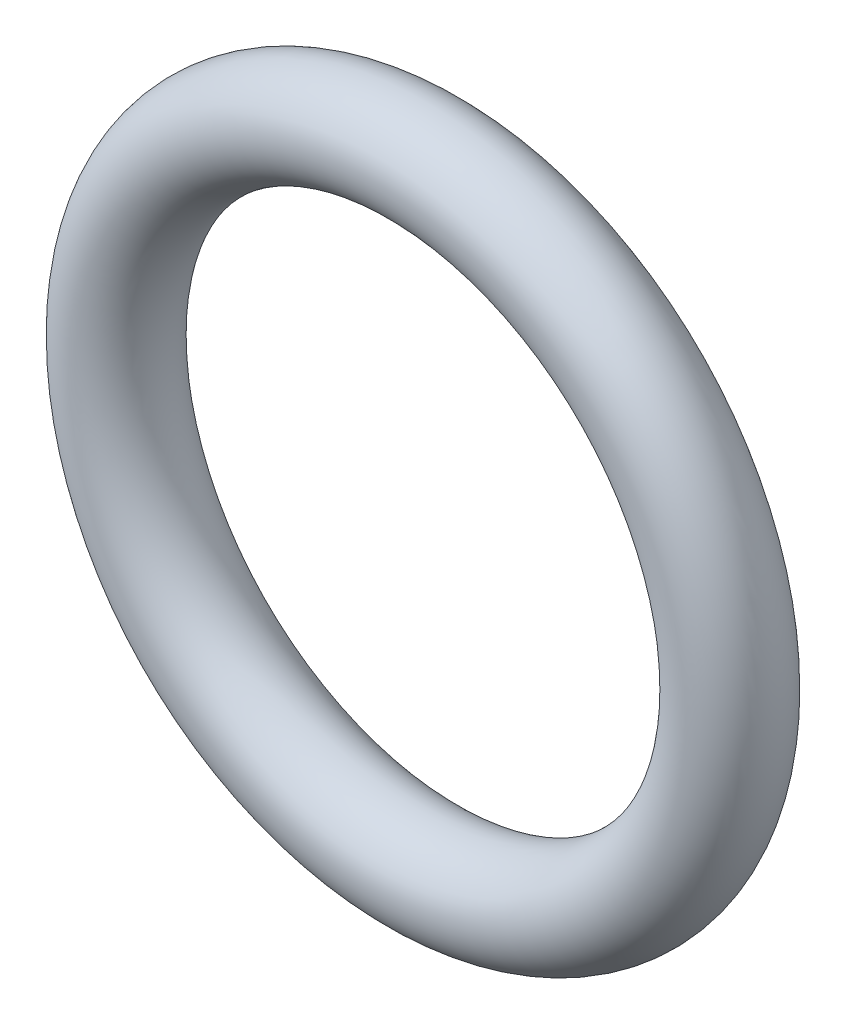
ISO-10303-21;
HEADER;
FILE_DESCRIPTION(('STEP AP214'),'2;1');
FILE_NAME('part.step','',(''),(''),'','','');
FILE_SCHEMA(('AUTOMOTIVE_DESIGN { 1 0 10303 214 1 1 1 1 }'));
ENDSEC;
DATA;
#1=APPLICATION_CONTEXT('core data for automotive mechanical design processes');
#2=APPLICATION_PROTOCOL_DEFINITION('international standard','automotive_design',2000,#1);
#3=PRODUCT_CONTEXT('',#1,'mechanical');
#4=PRODUCT('Part','Part','',(#3));
#5=PRODUCT_RELATED_PRODUCT_CATEGORY('part','',(#4));
#6=PRODUCT_DEFINITION_FORMATION('','',#4);
#7=PRODUCT_DEFINITION_CONTEXT('part definition',#1,'design');
#8=PRODUCT_DEFINITION('design','',#6,#7);
#9=PRODUCT_DEFINITION_SHAPE('','',#8);
#10=(LENGTH_UNIT() NAMED_UNIT(*) SI_UNIT(.MILLI.,.METRE.));
#11=(NAMED_UNIT(*) PLANE_ANGLE_UNIT() SI_UNIT($,.RADIAN.));
#12=(NAMED_UNIT(*) SI_UNIT($,.STERADIAN.) SOLID_ANGLE_UNIT());
#13=UNCERTAINTY_MEASURE_WITH_UNIT(LENGTH_MEASURE(1.E-05),#10,'distance_accuracy_value','');
#14=(GEOMETRIC_REPRESENTATION_CONTEXT(3) GLOBAL_UNCERTAINTY_ASSIGNED_CONTEXT((#13)) GLOBAL_UNIT_ASSIGNED_CONTEXT((#10,
#11,#12)) REPRESENTATION_CONTEXT('',''));
#15=CARTESIAN_POINT('',(0.,0.,0.));
#16=DIRECTION('',(0.,0.,1.));
#17=DIRECTION('',(1.,0.,0.));
#18=AXIS2_PLACEMENT_3D('',#15,#16,#17);
#19=CARTESIAN_POINT('',(0.,0.,0.));
#20=DIRECTION('',(0.,0.,1.));
#21=DIRECTION('',(1.,0.,0.));
#22=AXIS2_PLACEMENT_3D('',#19,#20,#21);
#23=TOROIDAL_SURFACE('',#22,5.5118,0.888999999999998);
#24=CARTESIAN_POINT('',(6.4008,0.,0.));
#25=VERTEX_POINT('',#24);
#26=VERTEX_LOOP('',#25);
#27=FACE_BOUND('',#26,.T.);
#28=ADVANCED_FACE('F38',(#27),#23,.T.);
#29=CLOSED_SHELL('',(#28));
#30=MANIFOLD_SOLID_BREP('B2',#29);
#31=ADVANCED_BREP_SHAPE_REPRESENTATION('',(#18,#30),#14);
#32=SHAPE_DEFINITION_REPRESENTATION(#9,#31);
ENDSEC;
END-ISO-10303-21;
